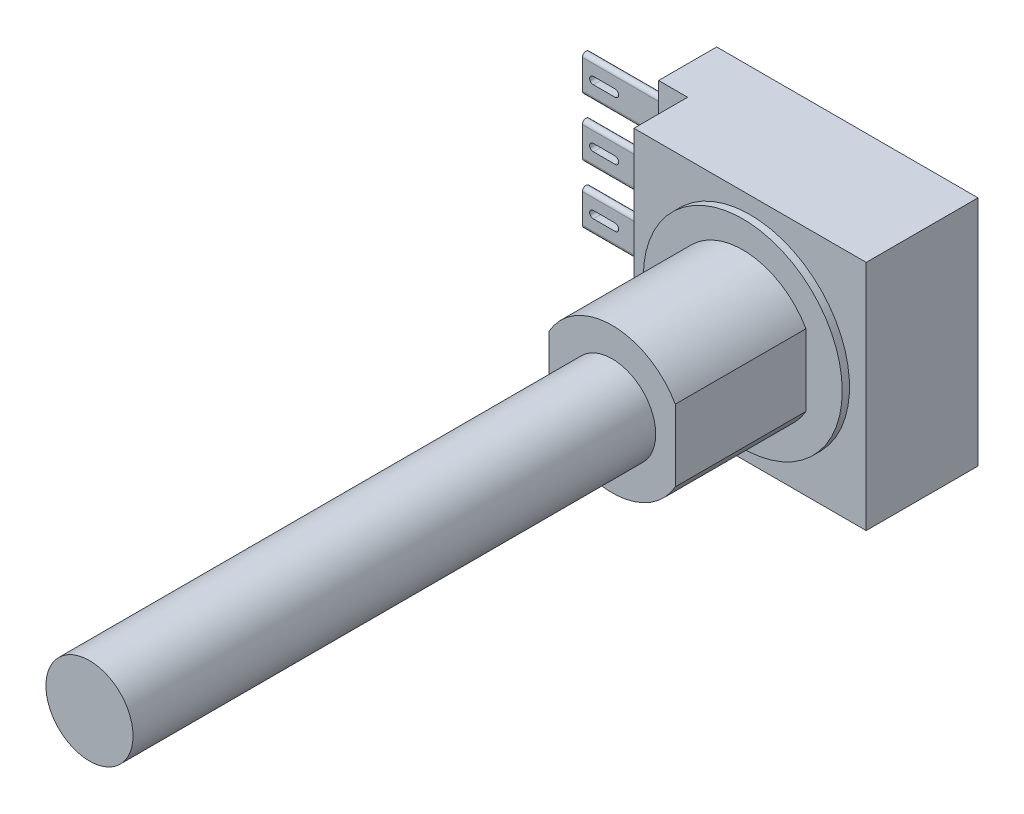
from build123d import *

# Parameters (mm, degrees)
SKICA1_W                 = 18
SKICA1_H                 = 16
P_IDAT_VYSUNUT_M1_DEPTH  = 4
SKICA2_W                 = 16
SKICA2_H                 = 16
P_IDAT_VYSUNUT_M2_DEPTH  = 3.7
SKICA3_R                 = 6.85
P_IDAT_VYSUNUT_M3_DEPTH  = 0.5
SKICA4_R                 = 5
P_IDAT_VYSUNUT_M4_DEPTH  = 9
SKICA5_R                 = 3
P_IDAT_VYSUNUT_M5_DEPTH  = 36
SKICA6_OUTSIDE_W         = 31.68
SKICA6_OUTSIDE_H         = 29.68
SKICA6_OUTSIDE_W_2       = 8.7
SKICA6_OUTSIDE_H_2       = 11
ODEBRAT_VYSUNUT_M2_DEPTH = 9
P_IDAT_VYSUNUT_M6_DEPTH  = 7
ODEBRAT_VYSUNUT_M3_DEPTH = 60.442791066


with BuildPart() as part:
    # Skica1 → P_idat vysunut_m1 (new body)
    with BuildSketch(Plane.XY):
        with Locations((-11.804223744, -4.824509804)):
            Rectangle(SKICA1_W, SKICA1_H)
    extrude(amount=P_IDAT_VYSUNUT_M1_DEPTH)

    # Skica2 → P_idat vysunut_m2 (add)
    with BuildSketch(Plane.XY.offset(4)):
        with Locations((-10.804223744, -4.824509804)):
            Rectangle(SKICA2_W, SKICA2_H)
    extrude(amount=P_IDAT_VYSUNUT_M2_DEPTH)

    # Skica3 → P_idat vysunut_m3 (add)
    with BuildSketch(Plane.XY.offset(7.7)):
        with Locations(Location((-10.804223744, -4.824509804, 0), (0, 0, 180))):
            Circle(SKICA3_R)
    extrude(amount=P_IDAT_VYSUNUT_M3_DEPTH)

    # Skica4 → P_idat vysunut_m4 (add)
    with BuildSketch(Plane.XY.offset(8.2)):
        with Locations((-10.804223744, -4.824509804)):
            Circle(SKICA4_R)
    extrude(amount=P_IDAT_VYSUNUT_M4_DEPTH)

    # Skica5 → P_idat vysunut_m5 (add)
    with BuildSketch(Plane.XY.offset(17.2)):
        with Locations((-10.804223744, -4.824509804)):
            Circle(SKICA5_R)
    extrude(amount=P_IDAT_VYSUNUT_M5_DEPTH)

    # Skica6 outside → Odebrat vysunut_m2 (cut)
    with BuildSketch(Plane.XY.offset(17.2)):
        with Locations((-11.804, -4.825)):
            Rectangle(SKICA6_OUTSIDE_W, SKICA6_OUTSIDE_H)
        with Locations((-10.804223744, -4.824509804)):
            Rectangle(SKICA6_OUTSIDE_W_2, SKICA6_OUTSIDE_H_2, mode=Mode.SUBTRACT)
    extrude(amount=-ODEBRAT_VYSUNUT_M2_DEPTH, mode=Mode.SUBTRACT)

    # Skica7 → P_idat vysunut_m6 (add)
    with BuildSketch(Plane.ZY.offset(20.804223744)):
        with BuildLine():
            Line((2.25, -3.824509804), (2.25, -5.824509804))
            ThreePointArc((2.25, -5.824509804), (2, -6.074509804), (1.75, -5.824509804))
            Line((1.75, -5.824509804), (1.75, -3.824509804))
            ThreePointArc((1.75, -3.824509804), (2, -3.574509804), (2.25, -3.824509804))
        make_face()
        with BuildLine():
            Line((2.25, 0.175490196), (2.25, -1.824509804))
            ThreePointArc((2.25, -1.824509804), (2, -2.074509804), (1.75, -1.824509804))
            Line((1.75, -1.824509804), (1.75, 0.175490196))
            ThreePointArc((1.75, 0.175490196), (2, 0.425490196), (2.25, 0.175490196))
        make_face()
        with BuildLine():
            Line((2.25, -7.824509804), (2.25, -9.824509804))
            ThreePointArc((2.25, -9.824509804), (2, -10.074509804), (1.75, -9.824509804))
            Line((1.75, -9.824509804), (1.75, -7.824509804))
            ThreePointArc((1.75, -7.824509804), (2, -7.574509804), (2.25, -7.824509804))
        make_face()
    extrude(amount=P_IDAT_VYSUNUT_M6_DEPTH)

    # Skica8 → Odebrat vysunut_m3 (cut, through all)
    with BuildSketch(Plane.XY.offset(2.25)):
        with BuildLine():
            Line((-27.051971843, -4.574509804), (-25.551971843, -4.574509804))
            ThreePointArc((-25.551971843, -4.574509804), (-25.301971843, -4.824509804), (-25.551971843, -5.074509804))
            Line((-25.551971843, -5.074509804), (-27.051971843, -5.074509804))
            ThreePointArc((-27.051971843, -5.074509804), (-27.301971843, -4.824509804), (-27.051971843, -4.574509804))
        make_face()
        with BuildLine():
            Line((-27.054223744, -0.574509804), (-25.554223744, -0.574509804))
            ThreePointArc((-25.554223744, -0.574509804), (-25.304223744, -0.824509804), (-25.554223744, -1.074509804))
            Line((-25.554223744, -1.074509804), (-27.054223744, -1.074509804))
            ThreePointArc((-27.054223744, -1.074509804), (-27.304223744, -0.824509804), (-27.054223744, -0.574509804))
        make_face()
        with BuildLine():
            Line((-27.054223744, -8.574509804), (-25.554223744, -8.574509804))
            ThreePointArc((-25.554223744, -8.574509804), (-25.304223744, -8.824509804), (-25.554223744, -9.074509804))
            Line((-25.554223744, -9.074509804), (-27.054223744, -9.074509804))
            ThreePointArc((-27.054223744, -9.074509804), (-27.304223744, -8.824509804), (-27.054223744, -8.574509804))
        make_face()
    extrude(amount=-ODEBRAT_VYSUNUT_M3_DEPTH, mode=Mode.SUBTRACT)


solid = part.part
